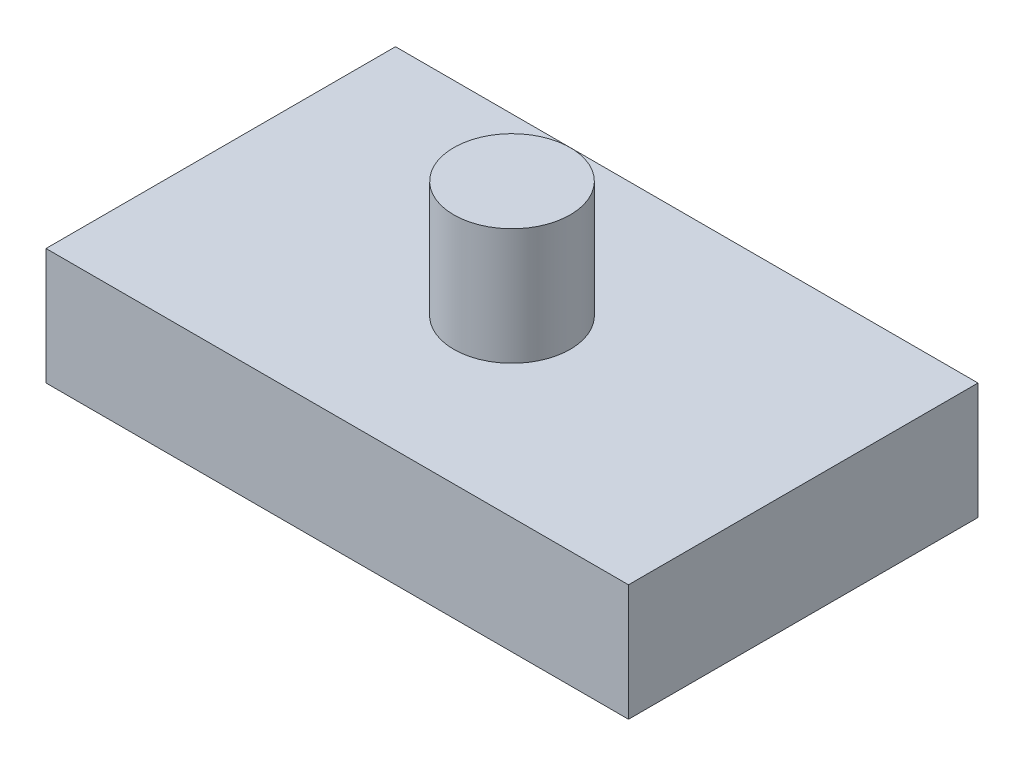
ISO-10303-21;
HEADER;
FILE_DESCRIPTION(('STEP AP214'),'2;1');
FILE_NAME('part.step','',(''),(''),'','','');
FILE_SCHEMA(('AUTOMOTIVE_DESIGN { 1 0 10303 214 1 1 1 1 }'));
ENDSEC;
DATA;
#1=APPLICATION_CONTEXT('core data for automotive mechanical design processes');
#2=APPLICATION_PROTOCOL_DEFINITION('international standard','automotive_design',2000,#1);
#3=PRODUCT_CONTEXT('',#1,'mechanical');
#4=PRODUCT('Part','Part','',(#3));
#5=PRODUCT_RELATED_PRODUCT_CATEGORY('part','',(#4));
#6=PRODUCT_DEFINITION_FORMATION('','',#4);
#7=PRODUCT_DEFINITION_CONTEXT('part definition',#1,'design');
#8=PRODUCT_DEFINITION('design','',#6,#7);
#9=PRODUCT_DEFINITION_SHAPE('','',#8);
#10=(LENGTH_UNIT() NAMED_UNIT(*) SI_UNIT(.MILLI.,.METRE.));
#11=(NAMED_UNIT(*) PLANE_ANGLE_UNIT() SI_UNIT($,.RADIAN.));
#12=(NAMED_UNIT(*) SI_UNIT($,.STERADIAN.) SOLID_ANGLE_UNIT());
#13=UNCERTAINTY_MEASURE_WITH_UNIT(LENGTH_MEASURE(1.E-05),#10,'distance_accuracy_value','');
#14=(GEOMETRIC_REPRESENTATION_CONTEXT(3) GLOBAL_UNCERTAINTY_ASSIGNED_CONTEXT((#13)) GLOBAL_UNIT_ASSIGNED_CONTEXT((#10,
#11,#12)) REPRESENTATION_CONTEXT('',''));
#15=CARTESIAN_POINT('',(0.,0.,0.));
#16=DIRECTION('',(0.,0.,1.));
#17=DIRECTION('',(1.,0.,0.));
#18=AXIS2_PLACEMENT_3D('',#15,#16,#17);
#19=CARTESIAN_POINT('',(25.,10.,15.));
#20=DIRECTION('',(-1.,0.,0.));
#21=DIRECTION('',(0.,0.,1.));
#22=AXIS2_PLACEMENT_3D('',#19,#20,#21);
#23=PLANE('',#22);
#24=DIRECTION('',(0.,0.,-1.));
#25=VECTOR('',#24,1.);
#26=CARTESIAN_POINT('',(25.,0.,15.));
#27=LINE('',#26,#25);
#28=CARTESIAN_POINT('',(25.,0.,15.));
#29=VERTEX_POINT('',#28);
#30=CARTESIAN_POINT('',(25.,0.,-15.));
#31=VERTEX_POINT('',#30);
#32=EDGE_CURVE('E99',#29,#31,#27,.T.);
#33=ORIENTED_EDGE('',*,*,#32,.T.);
#34=DIRECTION('',(0.,-1.,0.));
#35=VECTOR('',#34,1.);
#36=CARTESIAN_POINT('',(25.,10.,-15.));
#37=LINE('',#36,#35);
#38=CARTESIAN_POINT('',(25.,10.,-15.));
#39=VERTEX_POINT('',#38);
#40=EDGE_CURVE('E36',#39,#31,#37,.T.);
#41=ORIENTED_EDGE('',*,*,#40,.F.);
#42=DIRECTION('',(0.,0.,-1.));
#43=VECTOR('',#42,1.);
#44=CARTESIAN_POINT('',(25.,10.,15.));
#45=LINE('',#44,#43);
#46=CARTESIAN_POINT('',(25.,10.,15.));
#47=VERTEX_POINT('',#46);
#48=EDGE_CURVE('E86',#47,#39,#45,.T.);
#49=ORIENTED_EDGE('',*,*,#48,.F.);
#50=DIRECTION('',(0.,-1.,0.));
#51=VECTOR('',#50,1.);
#52=CARTESIAN_POINT('',(25.,10.,15.));
#53=LINE('',#52,#51);
#54=EDGE_CURVE('E95',#47,#29,#53,.T.);
#55=ORIENTED_EDGE('',*,*,#54,.T.);
#56=EDGE_LOOP('',(#33,#41,#49,#55));
#57=FACE_BOUND('',#56,.T.);
#58=ADVANCED_FACE('F33',(#57),#23,.F.);
#59=CARTESIAN_POINT('',(-25.,10.,-15.));
#60=DIRECTION('',(0.,0.,1.));
#61=DIRECTION('',(1.,0.,0.));
#62=AXIS2_PLACEMENT_3D('',#59,#60,#61);
#63=PLANE('',#62);
#64=DIRECTION('',(-1.,0.,0.));
#65=VECTOR('',#64,1.);
#66=CARTESIAN_POINT('',(-25.,0.,-15.));
#67=LINE('',#66,#65);
#68=CARTESIAN_POINT('',(-25.,0.,-15.));
#69=VERTEX_POINT('',#68);
#70=EDGE_CURVE('E91',#31,#69,#67,.T.);
#71=ORIENTED_EDGE('',*,*,#70,.T.);
#72=DIRECTION('',(0.,-1.,0.));
#73=VECTOR('',#72,1.);
#74=CARTESIAN_POINT('',(-25.,10.,-15.));
#75=LINE('',#74,#73);
#76=CARTESIAN_POINT('',(-25.,10.,-15.));
#77=VERTEX_POINT('',#76);
#78=EDGE_CURVE('E89',#77,#69,#75,.T.);
#79=ORIENTED_EDGE('',*,*,#78,.F.);
#80=DIRECTION('',(-1.,0.,0.));
#81=VECTOR('',#80,1.);
#82=CARTESIAN_POINT('',(-25.,10.,-15.));
#83=LINE('',#82,#81);
#84=EDGE_CURVE('E81',#39,#77,#83,.T.);
#85=ORIENTED_EDGE('',*,*,#84,.F.);
#86=ORIENTED_EDGE('',*,*,#40,.T.);
#87=EDGE_LOOP('',(#71,#79,#85,#86));
#88=FACE_BOUND('',#87,.T.);
#89=ADVANCED_FACE('F90',(#88),#63,.F.);
#90=CARTESIAN_POINT('',(-25.,10.,15.));
#91=DIRECTION('',(1.,0.,0.));
#92=DIRECTION('',(0.,0.,-1.));
#93=AXIS2_PLACEMENT_3D('',#90,#91,#92);
#94=PLANE('',#93);
#95=DIRECTION('',(0.,0.,1.));
#96=VECTOR('',#95,1.);
#97=CARTESIAN_POINT('',(-25.,0.,15.));
#98=LINE('',#97,#96);
#99=CARTESIAN_POINT('',(-25.,0.,15.));
#100=VERTEX_POINT('',#99);
#101=EDGE_CURVE('E67',#69,#100,#98,.T.);
#102=ORIENTED_EDGE('',*,*,#101,.T.);
#103=DIRECTION('',(0.,-1.,0.));
#104=VECTOR('',#103,1.);
#105=CARTESIAN_POINT('',(-25.,10.,15.));
#106=LINE('',#105,#104);
#107=CARTESIAN_POINT('',(-25.,10.,15.));
#108=VERTEX_POINT('',#107);
#109=EDGE_CURVE('E92',#108,#100,#106,.T.);
#110=ORIENTED_EDGE('',*,*,#109,.F.);
#111=DIRECTION('',(0.,0.,1.));
#112=VECTOR('',#111,1.);
#113=CARTESIAN_POINT('',(-25.,10.,15.));
#114=LINE('',#113,#112);
#115=EDGE_CURVE('E84',#77,#108,#114,.T.);
#116=ORIENTED_EDGE('',*,*,#115,.F.);
#117=ORIENTED_EDGE('',*,*,#78,.T.);
#118=EDGE_LOOP('',(#102,#110,#116,#117));
#119=FACE_BOUND('',#118,.T.);
#120=ADVANCED_FACE('F93',(#119),#94,.F.);
#121=CARTESIAN_POINT('',(-25.,10.,15.));
#122=DIRECTION('',(0.,0.,-1.));
#123=DIRECTION('',(-1.,0.,0.));
#124=AXIS2_PLACEMENT_3D('',#121,#122,#123);
#125=PLANE('',#124);
#126=DIRECTION('',(1.,0.,0.));
#127=VECTOR('',#126,1.);
#128=CARTESIAN_POINT('',(-25.,0.,15.));
#129=LINE('',#128,#127);
#130=EDGE_CURVE('E73',#100,#29,#129,.T.);
#131=ORIENTED_EDGE('',*,*,#130,.T.);
#132=ORIENTED_EDGE('',*,*,#54,.F.);
#133=DIRECTION('',(1.,0.,0.));
#134=VECTOR('',#133,1.);
#135=CARTESIAN_POINT('',(-25.,10.,15.));
#136=LINE('',#135,#134);
#137=EDGE_CURVE('E50',#108,#47,#136,.T.);
#138=ORIENTED_EDGE('',*,*,#137,.F.);
#139=ORIENTED_EDGE('',*,*,#109,.T.);
#140=EDGE_LOOP('',(#131,#132,#138,#139));
#141=FACE_BOUND('',#140,.T.);
#142=ADVANCED_FACE('F107',(#141),#125,.F.);
#143=CARTESIAN_POINT('',(0.,10.,0.));
#144=DIRECTION('',(0.,-1.,0.));
#145=DIRECTION('',(0.,0.,-1.));
#146=AXIS2_PLACEMENT_3D('',#143,#144,#145);
#147=PLANE('',#146);
#148=CARTESIAN_POINT('',(0.,10.,0.));
#149=DIRECTION('',(0.,1.,0.));
#150=DIRECTION('',(0.,0.,1.));
#151=AXIS2_PLACEMENT_3D('',#148,#149,#150);
#152=CIRCLE('',#151,5.);
#153=CARTESIAN_POINT('',(0.,10.,5.));
#154=VERTEX_POINT('',#153);
#155=EDGE_CURVE('E11',#154,#154,#152,.T.);
#156=ORIENTED_EDGE('',*,*,#155,.F.);
#157=EDGE_LOOP('',(#156));
#158=FACE_BOUND('',#157,.T.);
#159=ORIENTED_EDGE('',*,*,#48,.T.);
#160=ORIENTED_EDGE('',*,*,#84,.T.);
#161=ORIENTED_EDGE('',*,*,#115,.T.);
#162=ORIENTED_EDGE('',*,*,#137,.T.);
#163=EDGE_LOOP('',(#159,#160,#161,#162));
#164=FACE_BOUND('',#163,.T.);
#165=ADVANCED_FACE('F82',(#158,#164),#147,.F.);
#166=CARTESIAN_POINT('',(0.,0.,0.));
#167=DIRECTION('',(0.,-1.,0.));
#168=DIRECTION('',(0.,0.,-1.));
#169=AXIS2_PLACEMENT_3D('',#166,#167,#168);
#170=PLANE('',#169);
#171=ORIENTED_EDGE('',*,*,#32,.F.);
#172=ORIENTED_EDGE('',*,*,#130,.F.);
#173=ORIENTED_EDGE('',*,*,#101,.F.);
#174=ORIENTED_EDGE('',*,*,#70,.F.);
#175=EDGE_LOOP('',(#171,#172,#173,#174));
#176=FACE_BOUND('',#175,.T.);
#177=ADVANCED_FACE('F110',(#176),#170,.T.);
#178=CARTESIAN_POINT('',(0.,20.,0.));
#179=DIRECTION('',(0.,-1.,0.));
#180=DIRECTION('',(0.,0.,-1.));
#181=AXIS2_PLACEMENT_3D('',#178,#179,#180);
#182=CYLINDRICAL_SURFACE('',#181,5.);
#183=CARTESIAN_POINT('',(0.,20.,0.));
#184=DIRECTION('',(0.,1.,0.));
#185=DIRECTION('',(0.,0.,1.));
#186=AXIS2_PLACEMENT_3D('',#183,#184,#185);
#187=CIRCLE('',#186,5.);
#188=CARTESIAN_POINT('',(0.,20.,5.));
#189=VERTEX_POINT('',#188);
#190=EDGE_CURVE('E102',#189,#189,#187,.T.);
#191=ORIENTED_EDGE('',*,*,#190,.F.);
#192=EDGE_LOOP('',(#191));
#193=FACE_BOUND('',#192,.T.);
#194=ORIENTED_EDGE('',*,*,#155,.T.);
#195=EDGE_LOOP('',(#194));
#196=FACE_BOUND('',#195,.T.);
#197=ADVANCED_FACE('F118',(#193,#196),#182,.T.);
#198=CARTESIAN_POINT('',(0.,20.,0.));
#199=DIRECTION('',(0.,1.,0.));
#200=DIRECTION('',(0.,0.,1.));
#201=AXIS2_PLACEMENT_3D('',#198,#199,#200);
#202=PLANE('',#201);
#203=ORIENTED_EDGE('',*,*,#190,.T.);
#204=EDGE_LOOP('',(#203));
#205=FACE_BOUND('',#204,.T.);
#206=ADVANCED_FACE('F116',(#205),#202,.T.);
#207=CLOSED_SHELL('',(#58,#89,#120,#142,#165,#177,#197,#206));
#208=MANIFOLD_SOLID_BREP('B2',#207);
#209=ADVANCED_BREP_SHAPE_REPRESENTATION('',(#18,#208),#14);
#210=SHAPE_DEFINITION_REPRESENTATION(#9,#209);
ENDSEC;
END-ISO-10303-21;
